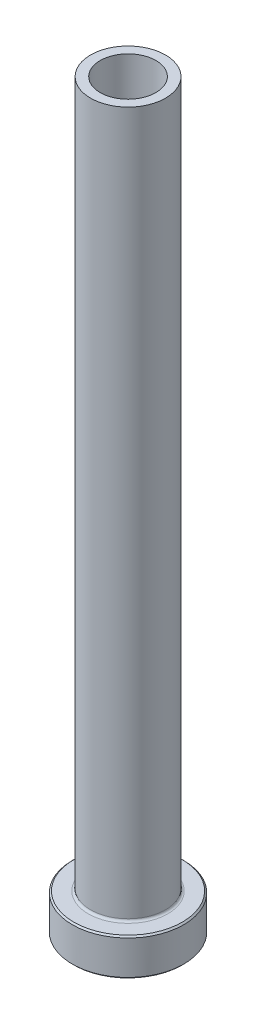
from build123d import *

# Parameters (mm, degrees)
CHAMFER1_SIZE = 0.254


with BuildPart() as part:
    # Sketch1 → Revolve1 (revolve)
    with BuildSketch(Plane.XY, mode=Mode.PRIVATE) as revolve1_sk:
        with BuildLine():
            Line((0, 0), (9.525, 0))
            Line((9.525, 0), (9.525, 6.35))
            Line((9.525, 6.35), (6.804025, 6.35))
            ThreePointArc((6.804025, 6.35), (6.523391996, 6.466241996), (6.40715, 6.746875))
            Line((6.40715, 6.746875), (6.40715, 127))
            Line((6.40715, 127), (0, 127))
            Line((0, 127), (0, 0))
        make_face()
    revolve(revolve1_sk.sketch.rotate(Axis((0, 0, 0), (0, 1, 0)), 90), axis=Axis((0, 0, 0), (0, 1, 0)))

    # Sketch2 → Cut-Revolve1 (revolve, cut)
    with BuildSketch(Plane.XY, mode=Mode.PRIVATE) as cut_revolve1_sk:
        Polygon((5.349875, 0), (4.953, 0.396875), (4.953, 52.5145), (4.7625, 66.802), (4.7625, 127), (0, 127), (0, 0), align=None)
    revolve(cut_revolve1_sk.sketch.rotate(Axis((0, 0, 0), (0, 1, 0)), 90), axis=Axis((0, 0, 0), (0, 1, 0)), mode=Mode.SUBTRACT)

    # Chamfer1
    chamfer1_edges = [part.edges().sort_by_distance(p)[0] for p in [
        (0, 6.35, 9.525),
        (0, 0, 9.525),
    ]]
    chamfer(chamfer1_edges, length=CHAMFER1_SIZE)


solid = part.part
